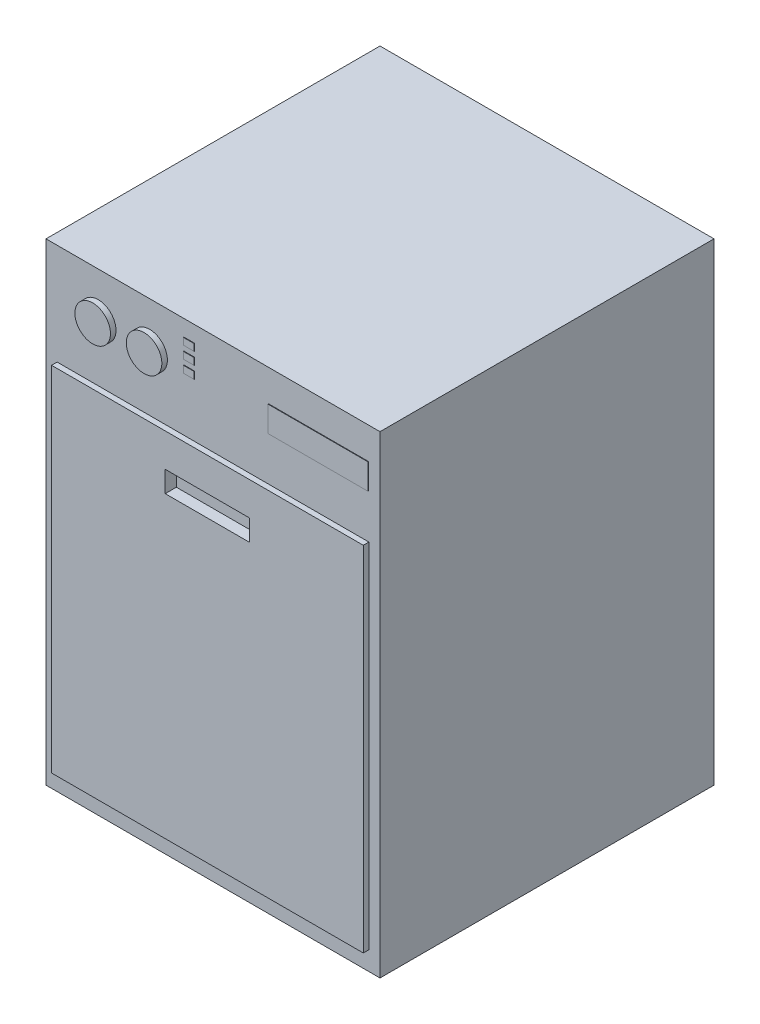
from build123d import *

# Parameters (mm, degrees)
ESQUISSE1_W             = 600
ESQUISSE1_H             = 600
BOSS_EXTRU_1_DEPTH      = 850
ESQUISSE3_R             = 31.929504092
BOSS_EXTRU_2_DEPTH      = 10
ESQUISSE5_W             = 560
ESQUISSE5_H             = 634.343179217
BOSS_EXTRU_4_DEPTH      = 10
ESQUISSE6_W             = 151.652279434
ESQUISSE6_H             = 37.913069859
ENL_V_MAT_EXTRU_1_DEPTH = 20
ESQUISSE7_W             = 179.229417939
ESQUISSE7_H             = 45.770976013
BOSS_EXTRU_5_DEPTH      = 1
ESQUISSE8_W             = 19.48412397
ESQUISSE8_H             = 12.061600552
ESQUISSE8_H_2           = 12.13297097
ESQUISSE8_H_3           = 12.31811423
BOSS_EXTRU_6_DEPTH      = 1


with BuildPart() as part:
    # Esquisse1 → Boss.-Extru.1 (new body)
    with BuildSketch(Plane(origin=(0, 0, 0), x_dir=(1, 0, 0), z_dir=(0, 1, 0))):
        Rectangle(ESQUISSE1_W, ESQUISSE1_H)
    extrude(amount=BOSS_EXTRU_1_DEPTH)

    # Esquisse3 → Boss.-Extru.2 (add)
    with BuildSketch(Plane.XY.offset(300)):
        with Locations(Location((-206.205810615, 770.356504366, 0), (0, 0, 180))):
            Circle(ESQUISSE3_R)
        with Locations(Location((-113.843092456, 770.356504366, 0), (0, 0, 180))):
            Circle(ESQUISSE3_R)
    extrude(amount=BOSS_EXTRU_2_DEPTH)

    # Esquisse5 → Boss.-Extru.4 (add)
    with BuildSketch(Plane.XY.offset(300)):
        with Locations((0, 351.084283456)):
            Rectangle(ESQUISSE5_W, ESQUISSE5_H)
    extrude(amount=BOSS_EXTRU_4_DEPTH)

    # Esquisse6 → Enl_v. mat.-Extru.1 (cut)
    with BuildSketch(Plane.XY.offset(310)):
        with Locations((0, 589.577189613)):
            Rectangle(ESQUISSE6_W, ESQUISSE6_H)
    extrude(amount=-ENL_V_MAT_EXTRU_1_DEPTH, mode=Mode.SUBTRACT)

    # Esquisse7 → Boss.-Extru.5 (add)
    with BuildSketch(Plane.XY.offset(300)):
        with Locations((189.658445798, 770.339388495)):
            Rectangle(ESQUISSE7_W, ESQUISSE7_H)
    extrude(amount=BOSS_EXTRU_5_DEPTH)

    # Esquisse8 → Boss.-Extru.6 (add)
    with BuildSketch(Plane.XY.offset(300)):
        with Locations((-42.647968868, 814.978295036)):
            Rectangle(ESQUISSE8_W, ESQUISSE8_H)
        with Locations((-42.647968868, 793.210317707)):
            Rectangle(ESQUISSE8_W, ESQUISSE8_H_2)
        with Locations((-42.647968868, 771.499226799)):
            Rectangle(ESQUISSE8_W, ESQUISSE8_H_3)
    extrude(amount=BOSS_EXTRU_6_DEPTH)


solid = part.part
